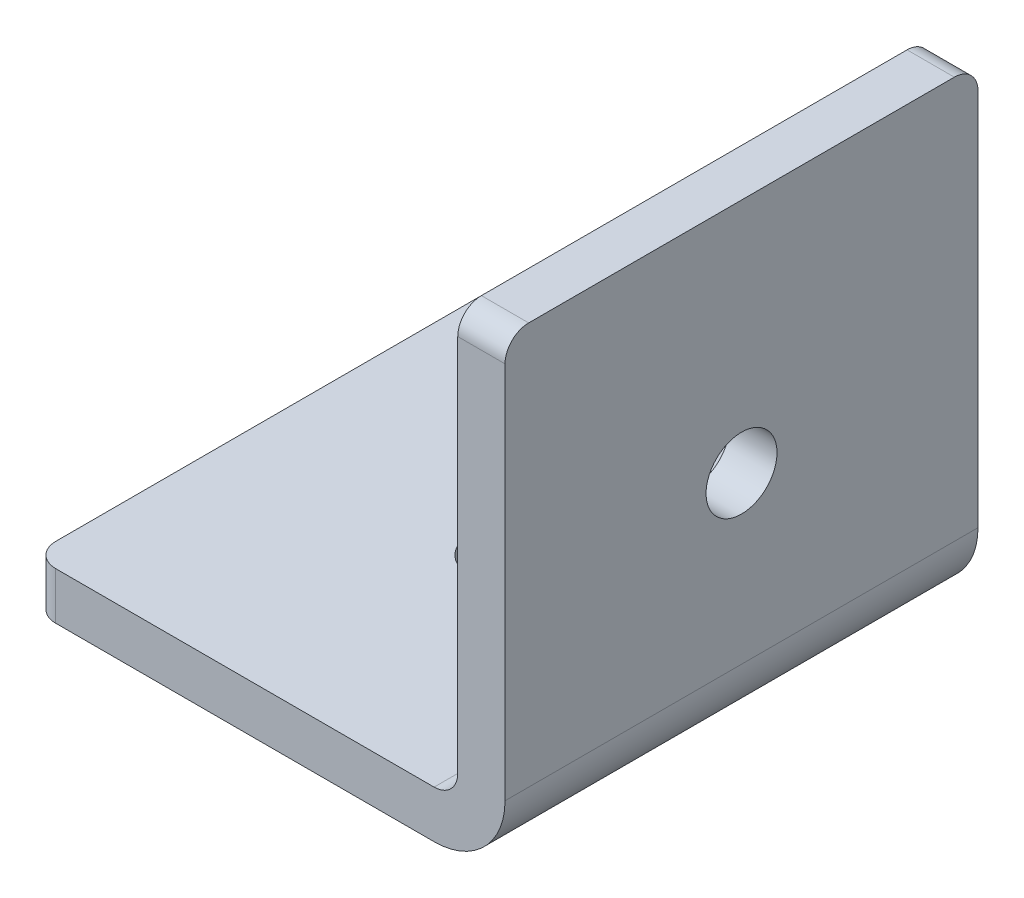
from build123d import *

# Parameters (mm, degrees)
BASE_EXTRU_MINCE_DEPTH  = 40
CONG_1_R                = 2
CONG_2_R                = 6
ESQUISSE2_R             = 3
ENL_V_MAT_EXTRU_1_DEPTH = 70.282032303
ESQUISSE3_R             = 3
ENL_V_MAT_EXTRU_2_DEPTH = 68.052218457


with BuildPart() as part:
    # Esquisse1 → Base-Extru.-Mince (new body)
    with BuildSketch(Plane.XY):
        Polygon((0, 0), (40, 0), (40, 40), (36, 40), (36, 4), (0, 4), align=None)
    extrude(amount=BASE_EXTRU_MINCE_DEPTH)

    # Cong_1
    cong_1_edges = [part.edges().sort_by_distance(p)[0] for p in [
        (38, 40, 0),
        (38, 40, 40),
        (36, 4, 20),
        (0, 2, 0),
        (0, 2, 40),
    ]]
    fillet(cong_1_edges, radius=CONG_1_R)

    # Cong_2
    cong_2_edges = [part.edges().sort_by_distance(p)[0] for p in [
        (40, 0, 20),
    ]]
    fillet(cong_2_edges, radius=CONG_2_R)

    # Esquisse2 → Enl_v. mat.-Extru.1 (cut, through all)
    with BuildSketch(Plane(origin=(40, 0, 0), x_dir=(0, 0, -1), z_dir=(1, 0, 0))):
        with Locations((-20, 20)):
            Circle(ESQUISSE2_R)
    extrude(amount=-ENL_V_MAT_EXTRU_1_DEPTH, mode=Mode.SUBTRACT)

    # Esquisse3 → Enl_v. mat.-Extru.2 (cut, through all)
    with BuildSketch(Plane(origin=(0, 4, 0), x_dir=(-1, 0, 0), z_dir=(0, 1, 0))):
        with Locations(Location((-20, 20, 0), (0, 0, 90))):
            Circle(ESQUISSE3_R)
    extrude(amount=-ENL_V_MAT_EXTRU_2_DEPTH, mode=Mode.SUBTRACT)


solid = part.part
